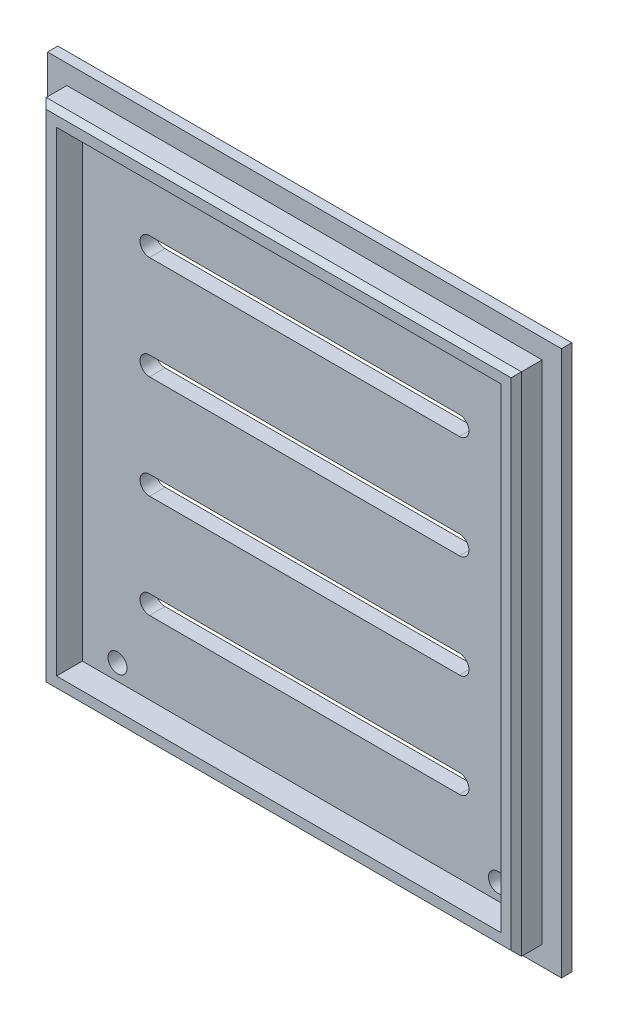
ISO-10303-21;
HEADER;
FILE_DESCRIPTION(('STEP AP214'),'2;1');
FILE_NAME('part.step','',(''),(''),'','','');
FILE_SCHEMA(('AUTOMOTIVE_DESIGN { 1 0 10303 214 1 1 1 1 }'));
ENDSEC;
DATA;
#1=APPLICATION_CONTEXT('core data for automotive mechanical design processes');
#2=APPLICATION_PROTOCOL_DEFINITION('international standard','automotive_design',2000,#1);
#3=PRODUCT_CONTEXT('',#1,'mechanical');
#4=PRODUCT('Part','Part','',(#3));
#5=PRODUCT_RELATED_PRODUCT_CATEGORY('part','',(#4));
#6=PRODUCT_DEFINITION_FORMATION('','',#4);
#7=PRODUCT_DEFINITION_CONTEXT('part definition',#1,'design');
#8=PRODUCT_DEFINITION('design','',#6,#7);
#9=PRODUCT_DEFINITION_SHAPE('','',#8);
#10=(LENGTH_UNIT() NAMED_UNIT(*) SI_UNIT(.MILLI.,.METRE.));
#11=(NAMED_UNIT(*) PLANE_ANGLE_UNIT() SI_UNIT($,.RADIAN.));
#12=(NAMED_UNIT(*) SI_UNIT($,.STERADIAN.) SOLID_ANGLE_UNIT());
#13=UNCERTAINTY_MEASURE_WITH_UNIT(LENGTH_MEASURE(1.E-05),#10,'distance_accuracy_value','');
#14=(GEOMETRIC_REPRESENTATION_CONTEXT(3) GLOBAL_UNCERTAINTY_ASSIGNED_CONTEXT((#13)) GLOBAL_UNIT_ASSIGNED_CONTEXT((#10,
#11,#12)) REPRESENTATION_CONTEXT('',''));
#15=CARTESIAN_POINT('',(0.,0.,0.));
#16=DIRECTION('',(0.,0.,1.));
#17=DIRECTION('',(1.,0.,0.));
#18=AXIS2_PLACEMENT_3D('',#15,#16,#17);
#19=CARTESIAN_POINT('',(0.,-132.75,-3475.09274967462));
#20=DIRECTION('',(0.,1.,0.));
#21=DIRECTION('',(0.,0.,1.));
#22=AXIS2_PLACEMENT_3D('',#19,#20,#21);
#23=PLANE('',#22);
#24=DIRECTION('',(1.,0.,0.));
#25=VECTOR('',#24,1.);
#26=CARTESIAN_POINT('',(0.,-132.75,-3480.09274967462));
#27=LINE('',#26,#25);
#28=CARTESIAN_POINT('',(-40.7499999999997,-132.75,-3480.09274967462));
#29=VERTEX_POINT('',#28);
#30=CARTESIAN_POINT('',(45.2500000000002,-132.75,-3480.09274967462));
#31=VERTEX_POINT('',#30);
#32=EDGE_CURVE('E448',#29,#31,#27,.T.);
#33=ORIENTED_EDGE('',*,*,#32,.F.);
#34=DIRECTION('',(0.,0.,-1.));
#35=VECTOR('',#34,1.);
#36=CARTESIAN_POINT('',(-40.7499999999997,-132.75,-3475.09274967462));
#37=LINE('',#36,#35);
#38=CARTESIAN_POINT('',(-40.7499999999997,-132.75,-3475.09274967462));
#39=VERTEX_POINT('',#38);
#40=EDGE_CURVE('E458',#39,#29,#37,.T.);
#41=ORIENTED_EDGE('',*,*,#40,.F.);
#42=DIRECTION('',(1.,0.,0.));
#43=VECTOR('',#42,1.);
#44=CARTESIAN_POINT('',(0.,-132.75,-3475.09274967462));
#45=LINE('',#44,#43);
#46=CARTESIAN_POINT('',(45.2500000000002,-132.75,-3475.09274967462));
#47=VERTEX_POINT('',#46);
#48=EDGE_CURVE('E424',#39,#47,#45,.T.);
#49=ORIENTED_EDGE('',*,*,#48,.T.);
#50=DIRECTION('',(0.,0.,-1.));
#51=VECTOR('',#50,1.);
#52=CARTESIAN_POINT('',(45.2500000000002,-132.75,-3475.09274967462));
#53=LINE('',#52,#51);
#54=EDGE_CURVE('E466',#47,#31,#53,.T.);
#55=ORIENTED_EDGE('',*,*,#54,.T.);
#56=EDGE_LOOP('',(#33,#41,#49,#55));
#57=FACE_BOUND('',#56,.T.);
#58=ADVANCED_FACE('F37',(#57),#23,.T.);
#59=CARTESIAN_POINT('',(-40.7499999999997,0.,-3475.09274967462));
#60=DIRECTION('',(-1.,0.,0.));
#61=DIRECTION('',(0.,0.,1.));
#62=AXIS2_PLACEMENT_3D('',#59,#60,#61);
#63=PLANE('',#62);
#64=DIRECTION('',(0.,1.,0.));
#65=VECTOR('',#64,1.);
#66=CARTESIAN_POINT('',(-40.7499999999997,0.,-3480.09274967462));
#67=LINE('',#66,#65);
#68=CARTESIAN_POINT('',(-40.7499999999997,-40.7499999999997,-3480.09274967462));
#69=VERTEX_POINT('',#68);
#70=EDGE_CURVE('E428',#29,#69,#67,.T.);
#71=ORIENTED_EDGE('',*,*,#70,.T.);
#72=DIRECTION('',(0.,0.,-1.));
#73=VECTOR('',#72,1.);
#74=CARTESIAN_POINT('',(-40.7499999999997,-40.7499999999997,-3475.09274967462));
#75=LINE('',#74,#73);
#76=CARTESIAN_POINT('',(-40.7499999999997,-40.7499999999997,-3475.09274967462));
#77=VERTEX_POINT('',#76);
#78=EDGE_CURVE('E461',#77,#69,#75,.T.);
#79=ORIENTED_EDGE('',*,*,#78,.F.);
#80=DIRECTION('',(0.,1.,0.));
#81=VECTOR('',#80,1.);
#82=CARTESIAN_POINT('',(-40.7499999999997,0.,-3475.09274967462));
#83=LINE('',#82,#81);
#84=EDGE_CURVE('E433',#39,#77,#83,.T.);
#85=ORIENTED_EDGE('',*,*,#84,.F.);
#86=ORIENTED_EDGE('',*,*,#40,.T.);
#87=EDGE_LOOP('',(#71,#79,#85,#86));
#88=FACE_BOUND('',#87,.T.);
#89=ADVANCED_FACE('F598',(#88),#63,.F.);
#90=CARTESIAN_POINT('',(0.,-40.7499999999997,-3475.09274967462));
#91=DIRECTION('',(0.,1.,0.));
#92=DIRECTION('',(0.,0.,1.));
#93=AXIS2_PLACEMENT_3D('',#90,#91,#92);
#94=PLANE('',#93);
#95=DIRECTION('',(1.,0.,0.));
#96=VECTOR('',#95,1.);
#97=CARTESIAN_POINT('',(0.,-40.7499999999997,-3480.09274967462));
#98=LINE('',#97,#96);
#99=CARTESIAN_POINT('',(45.2500000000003,-40.7499999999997,-3480.09274967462));
#100=VERTEX_POINT('',#99);
#101=EDGE_CURVE('E454',#69,#100,#98,.T.);
#102=ORIENTED_EDGE('',*,*,#101,.T.);
#103=DIRECTION('',(0.,0.,-1.));
#104=VECTOR('',#103,1.);
#105=CARTESIAN_POINT('',(45.2500000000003,-40.7499999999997,-3475.09274967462));
#106=LINE('',#105,#104);
#107=CARTESIAN_POINT('',(45.2500000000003,-40.7499999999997,-3475.09274967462));
#108=VERTEX_POINT('',#107);
#109=EDGE_CURVE('E463',#108,#100,#106,.T.);
#110=ORIENTED_EDGE('',*,*,#109,.F.);
#111=DIRECTION('',(1.,0.,0.));
#112=VECTOR('',#111,1.);
#113=CARTESIAN_POINT('',(0.,-40.7499999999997,-3475.09274967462));
#114=LINE('',#113,#112);
#115=EDGE_CURVE('E431',#77,#108,#114,.T.);
#116=ORIENTED_EDGE('',*,*,#115,.F.);
#117=ORIENTED_EDGE('',*,*,#78,.T.);
#118=EDGE_LOOP('',(#102,#110,#116,#117));
#119=FACE_BOUND('',#118,.T.);
#120=ADVANCED_FACE('F595',(#119),#94,.F.);
#121=CARTESIAN_POINT('',(0.,-37.7499999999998,-3475.09274967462));
#122=DIRECTION('',(0.,1.,0.));
#123=DIRECTION('',(0.,0.,1.));
#124=AXIS2_PLACEMENT_3D('',#121,#122,#123);
#125=PLANE('',#124);
#126=DIRECTION('',(0.,0.,-1.));
#127=VECTOR('',#126,1.);
#128=CARTESIAN_POINT('',(-43.7499999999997,-37.7499999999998,-3475.09274967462));
#129=LINE('',#128,#127);
#130=CARTESIAN_POINT('',(-43.7499999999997,-37.7499999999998,-3476.09274967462));
#131=VERTEX_POINT('',#130);
#132=CARTESIAN_POINT('',(-43.7499999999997,-37.7499999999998,-3480.09274967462));
#133=VERTEX_POINT('',#132);
#134=EDGE_CURVE('E468',#131,#133,#129,.T.);
#135=ORIENTED_EDGE('',*,*,#134,.F.);
#136=DIRECTION('',(1.,0.,0.));
#137=VECTOR('',#136,1.);
#138=CARTESIAN_POINT('',(48.2500000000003,-37.7499999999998,-3476.09274967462));
#139=LINE('',#138,#137);
#140=CARTESIAN_POINT('',(48.2500000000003,-37.7499999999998,-3476.09274967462));
#141=VERTEX_POINT('',#140);
#142=EDGE_CURVE('E460',#131,#141,#139,.T.);
#143=ORIENTED_EDGE('',*,*,#142,.T.);
#144=DIRECTION('',(0.,0.,-1.));
#145=VECTOR('',#144,1.);
#146=CARTESIAN_POINT('',(48.2500000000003,-37.7499999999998,-3475.09274967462));
#147=LINE('',#146,#145);
#148=CARTESIAN_POINT('',(48.2500000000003,-37.7499999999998,-3480.09274967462));
#149=VERTEX_POINT('',#148);
#150=EDGE_CURVE('E436',#141,#149,#147,.T.);
#151=ORIENTED_EDGE('',*,*,#150,.T.);
#152=DIRECTION('',(1.,0.,0.));
#153=VECTOR('',#152,1.);
#154=CARTESIAN_POINT('',(0.,-37.7499999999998,-3480.09274967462));
#155=LINE('',#154,#153);
#156=EDGE_CURVE('E423',#133,#149,#155,.T.);
#157=ORIENTED_EDGE('',*,*,#156,.F.);
#158=EDGE_LOOP('',(#135,#143,#151,#157));
#159=FACE_BOUND('',#158,.T.);
#160=ADVANCED_FACE('F621',(#159),#125,.T.);
#161=CARTESIAN_POINT('',(-43.7499999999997,0.,-3475.09274967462));
#162=DIRECTION('',(1.,0.,0.));
#163=DIRECTION('',(0.,1.,0.));
#164=AXIS2_PLACEMENT_3D('',#161,#162,#163);
#165=PLANE('',#164);
#166=DIRECTION('',(0.,0.,-1.));
#167=VECTOR('',#166,1.);
#168=CARTESIAN_POINT('',(-43.7499999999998,-135.75,-3475.09274967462));
#169=LINE('',#168,#167);
#170=CARTESIAN_POINT('',(-43.7499999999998,-135.75,-3476.09274967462));
#171=VERTEX_POINT('',#170);
#172=CARTESIAN_POINT('',(-43.7499999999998,-135.75,-3480.09274967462));
#173=VERTEX_POINT('',#172);
#174=EDGE_CURVE('E470',#171,#173,#169,.T.);
#175=ORIENTED_EDGE('',*,*,#174,.F.);
#176=DIRECTION('',(0.,1.,0.));
#177=VECTOR('',#176,1.);
#178=CARTESIAN_POINT('',(-43.7499999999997,0.,-3476.09274967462));
#179=LINE('',#178,#177);
#180=EDGE_CURVE('E486',#171,#131,#179,.T.);
#181=ORIENTED_EDGE('',*,*,#180,.T.);
#182=ORIENTED_EDGE('',*,*,#134,.T.);
#183=DIRECTION('',(0.,-1.,0.));
#184=VECTOR('',#183,1.);
#185=CARTESIAN_POINT('',(-43.7499999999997,0.,-3480.09274967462));
#186=LINE('',#185,#184);
#187=EDGE_CURVE('E445',#133,#173,#186,.T.);
#188=ORIENTED_EDGE('',*,*,#187,.T.);
#189=EDGE_LOOP('',(#175,#181,#182,#188));
#190=FACE_BOUND('',#189,.T.);
#191=ADVANCED_FACE('F617',(#190),#165,.F.);
#192=CARTESIAN_POINT('',(0.,-135.75,-3475.09274967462));
#193=DIRECTION('',(0.,1.,0.));
#194=DIRECTION('',(0.,0.,1.));
#195=AXIS2_PLACEMENT_3D('',#192,#193,#194);
#196=PLANE('',#195);
#197=DIRECTION('',(0.,0.,-1.));
#198=VECTOR('',#197,1.);
#199=CARTESIAN_POINT('',(48.2500000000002,-135.75,-3475.09274967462));
#200=LINE('',#199,#198);
#201=CARTESIAN_POINT('',(48.2500000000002,-135.75,-3476.09274967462));
#202=VERTEX_POINT('',#201);
#203=CARTESIAN_POINT('',(48.2500000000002,-135.75,-3480.09274967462));
#204=VERTEX_POINT('',#203);
#205=EDGE_CURVE('E472',#202,#204,#200,.T.);
#206=ORIENTED_EDGE('',*,*,#205,.F.);
#207=DIRECTION('',(-1.,0.,0.));
#208=VECTOR('',#207,1.);
#209=CARTESIAN_POINT('',(0.,-135.75,-3476.09274967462));
#210=LINE('',#209,#208);
#211=EDGE_CURVE('E488',#202,#171,#210,.T.);
#212=ORIENTED_EDGE('',*,*,#211,.T.);
#213=ORIENTED_EDGE('',*,*,#174,.T.);
#214=DIRECTION('',(1.,0.,0.));
#215=VECTOR('',#214,1.);
#216=CARTESIAN_POINT('',(0.,-135.75,-3480.09274967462));
#217=LINE('',#216,#215);
#218=EDGE_CURVE('E442',#173,#204,#217,.T.);
#219=ORIENTED_EDGE('',*,*,#218,.T.);
#220=EDGE_LOOP('',(#206,#212,#213,#219));
#221=FACE_BOUND('',#220,.T.);
#222=ADVANCED_FACE('F620',(#221),#196,.F.);
#223=CARTESIAN_POINT('',(48.2500000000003,0.,-3475.09274967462));
#224=DIRECTION('',(1.,0.,0.));
#225=DIRECTION('',(0.,1.,0.));
#226=AXIS2_PLACEMENT_3D('',#223,#224,#225);
#227=PLANE('',#226);
#228=ORIENTED_EDGE('',*,*,#150,.F.);
#229=DIRECTION('',(0.,-1.,0.));
#230=VECTOR('',#229,1.);
#231=CARTESIAN_POINT('',(48.2500000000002,-135.75,-3476.09274967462));
#232=LINE('',#231,#230);
#233=EDGE_CURVE('E490',#141,#202,#232,.T.);
#234=ORIENTED_EDGE('',*,*,#233,.T.);
#235=ORIENTED_EDGE('',*,*,#205,.T.);
#236=DIRECTION('',(0.,-1.,0.));
#237=VECTOR('',#236,1.);
#238=CARTESIAN_POINT('',(48.2500000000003,0.,-3480.09274967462));
#239=LINE('',#238,#237);
#240=EDGE_CURVE('E439',#149,#204,#239,.T.);
#241=ORIENTED_EDGE('',*,*,#240,.F.);
#242=EDGE_LOOP('',(#228,#234,#235,#241));
#243=FACE_BOUND('',#242,.T.);
#244=ADVANCED_FACE('F606',(#243),#227,.T.);
#245=CARTESIAN_POINT('',(45.2500000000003,0.,-3475.09274967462));
#246=DIRECTION('',(-1.,0.,0.));
#247=DIRECTION('',(0.,-1.,0.));
#248=AXIS2_PLACEMENT_3D('',#245,#246,#247);
#249=PLANE('',#248);
#250=DIRECTION('',(0.,1.,0.));
#251=VECTOR('',#250,1.);
#252=CARTESIAN_POINT('',(45.2500000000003,0.,-3480.09274967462));
#253=LINE('',#252,#251);
#254=EDGE_CURVE('E451',#31,#100,#253,.T.);
#255=ORIENTED_EDGE('',*,*,#254,.F.);
#256=ORIENTED_EDGE('',*,*,#54,.F.);
#257=DIRECTION('',(0.,1.,0.));
#258=VECTOR('',#257,1.);
#259=CARTESIAN_POINT('',(45.2500000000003,0.,-3475.09274967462));
#260=LINE('',#259,#258);
#261=EDGE_CURVE('E427',#47,#108,#260,.T.);
#262=ORIENTED_EDGE('',*,*,#261,.T.);
#263=ORIENTED_EDGE('',*,*,#109,.T.);
#264=EDGE_LOOP('',(#255,#256,#262,#263));
#265=FACE_BOUND('',#264,.T.);
#266=ADVANCED_FACE('F592',(#265),#249,.T.);
#267=CARTESIAN_POINT('',(0.,0.,-3475.09274967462));
#268=DIRECTION('',(0.,0.,-1.));
#269=DIRECTION('',(-1.,0.,0.));
#270=AXIS2_PLACEMENT_3D('',#267,#268,#269);
#271=PLANE('',#270);
#272=DIRECTION('',(0.,1.,0.));
#273=VECTOR('',#272,1.);
#274=CARTESIAN_POINT('',(47.2500000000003,-37.7499999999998,-3475.09274967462));
#275=LINE('',#274,#273);
#276=CARTESIAN_POINT('',(47.2500000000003,-134.75,-3475.09274967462));
#277=VERTEX_POINT('',#276);
#278=CARTESIAN_POINT('',(47.2500000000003,-38.7499999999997,-3475.09274967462));
#279=VERTEX_POINT('',#278);
#280=EDGE_CURVE('E477',#277,#279,#275,.T.);
#281=ORIENTED_EDGE('',*,*,#280,.T.);
#282=DIRECTION('',(-1.,0.,0.));
#283=VECTOR('',#282,1.);
#284=CARTESIAN_POINT('',(-43.7499999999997,-38.7499999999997,-3475.09274967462));
#285=LINE('',#284,#283);
#286=CARTESIAN_POINT('',(-42.7499999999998,-38.7499999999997,-3475.09274967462));
#287=VERTEX_POINT('',#286);
#288=EDGE_CURVE('E483',#279,#287,#285,.T.);
#289=ORIENTED_EDGE('',*,*,#288,.T.);
#290=DIRECTION('',(0.,-1.,0.));
#291=VECTOR('',#290,1.);
#292=CARTESIAN_POINT('',(-42.7499999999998,0.,-3475.09274967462));
#293=LINE('',#292,#291);
#294=CARTESIAN_POINT('',(-42.7499999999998,-134.75,-3475.09274967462));
#295=VERTEX_POINT('',#294);
#296=EDGE_CURVE('E481',#287,#295,#293,.T.);
#297=ORIENTED_EDGE('',*,*,#296,.T.);
#298=DIRECTION('',(1.,0.,0.));
#299=VECTOR('',#298,1.);
#300=CARTESIAN_POINT('',(0.,-134.75,-3475.09274967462));
#301=LINE('',#300,#299);
#302=EDGE_CURVE('E479',#295,#277,#301,.T.);
#303=ORIENTED_EDGE('',*,*,#302,.T.);
#304=EDGE_LOOP('',(#281,#289,#297,#303));
#305=FACE_BOUND('',#304,.T.);
#306=ORIENTED_EDGE('',*,*,#48,.F.);
#307=ORIENTED_EDGE('',*,*,#84,.T.);
#308=ORIENTED_EDGE('',*,*,#115,.T.);
#309=ORIENTED_EDGE('',*,*,#261,.F.);
#310=EDGE_LOOP('',(#306,#307,#308,#309));
#311=FACE_BOUND('',#310,.T.);
#312=ADVANCED_FACE('F580',(#305,#311),#271,.F.);
#313=CARTESIAN_POINT('',(0.,0.,-3480.09274967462));
#314=DIRECTION('',(0.,0.,-1.));
#315=DIRECTION('',(-1.,0.,0.));
#316=AXIS2_PLACEMENT_3D('',#313,#314,#315);
#317=PLANE('',#316);
#318=DIRECTION('',(1.,0.,0.));
#319=VECTOR('',#318,1.);
#320=CARTESIAN_POINT('',(32.2500000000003,-118.59,-3480.09274967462));
#321=LINE('',#320,#319);
#322=CARTESIAN_POINT('',(-27.7499999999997,-118.59,-3480.09274967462));
#323=VERTEX_POINT('',#322);
#324=CARTESIAN_POINT('',(32.2500000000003,-118.59,-3480.09274967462));
#325=VERTEX_POINT('',#324);
#326=EDGE_CURVE('E266',#323,#325,#321,.T.);
#327=ORIENTED_EDGE('',*,*,#326,.F.);
#328=CARTESIAN_POINT('',(-27.7499999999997,-116.75,-3480.09274967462));
#329=DIRECTION('',(0.,0.,1.));
#330=DIRECTION('',(-1.,0.,0.));
#331=AXIS2_PLACEMENT_3D('',#328,#329,#330);
#332=CIRCLE('',#331,1.84000000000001);
#333=CARTESIAN_POINT('',(-27.7499999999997,-114.91,-3480.09274967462));
#334=VERTEX_POINT('',#333);
#335=EDGE_CURVE('E54',#334,#323,#332,.T.);
#336=ORIENTED_EDGE('',*,*,#335,.F.);
#337=DIRECTION('',(-1.,0.,0.));
#338=VECTOR('',#337,1.);
#339=CARTESIAN_POINT('',(-27.7499999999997,-114.91,-3480.09274967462));
#340=LINE('',#339,#338);
#341=CARTESIAN_POINT('',(32.2500000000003,-114.91,-3480.09274967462));
#342=VERTEX_POINT('',#341);
#343=EDGE_CURVE('E259',#342,#334,#340,.T.);
#344=ORIENTED_EDGE('',*,*,#343,.F.);
#345=CARTESIAN_POINT('',(32.2500000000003,-116.75,-3480.09274967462));
#346=DIRECTION('',(0.,0.,1.));
#347=DIRECTION('',(-1.,0.,0.));
#348=AXIS2_PLACEMENT_3D('',#345,#346,#347);
#349=CIRCLE('',#348,1.84000000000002);
#350=EDGE_CURVE('E273',#325,#342,#349,.T.);
#351=ORIENTED_EDGE('',*,*,#350,.F.);
#352=EDGE_LOOP('',(#327,#336,#344,#351));
#353=FACE_BOUND('',#352,.T.);
#354=DIRECTION('',(-1.,0.,0.));
#355=VECTOR('',#354,1.);
#356=CARTESIAN_POINT('',(32.2500000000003,-94.9099999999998,-3480.09274967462));
#357=LINE('',#356,#355);
#358=CARTESIAN_POINT('',(32.2500000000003,-94.9099999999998,-3480.09274967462));
#359=VERTEX_POINT('',#358);
#360=CARTESIAN_POINT('',(-27.7499999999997,-94.9099999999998,-3480.09274967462));
#361=VERTEX_POINT('',#360);
#362=EDGE_CURVE('E292',#359,#361,#357,.T.);
#363=ORIENTED_EDGE('',*,*,#362,.F.);
#364=CARTESIAN_POINT('',(32.2500000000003,-96.7499999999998,-3480.09274967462));
#365=DIRECTION('',(0.,0.,1.));
#366=DIRECTION('',(1.,0.,0.));
#367=AXIS2_PLACEMENT_3D('',#364,#365,#366);
#368=CIRCLE('',#367,1.83999999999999);
#369=CARTESIAN_POINT('',(32.2500000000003,-98.5899999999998,-3480.09274967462));
#370=VERTEX_POINT('',#369);
#371=EDGE_CURVE('E290',#370,#359,#368,.T.);
#372=ORIENTED_EDGE('',*,*,#371,.F.);
#373=DIRECTION('',(1.,0.,0.));
#374=VECTOR('',#373,1.);
#375=CARTESIAN_POINT('',(-27.7499999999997,-98.5899999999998,-3480.09274967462));
#376=LINE('',#375,#374);
#377=CARTESIAN_POINT('',(-27.7499999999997,-98.5899999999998,-3480.09274967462));
#378=VERTEX_POINT('',#377);
#379=EDGE_CURVE('E298',#378,#370,#376,.T.);
#380=ORIENTED_EDGE('',*,*,#379,.F.);
#381=CARTESIAN_POINT('',(-27.7499999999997,-96.7499999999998,-3480.09274967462));
#382=DIRECTION('',(0.,0.,1.));
#383=DIRECTION('',(1.,0.,0.));
#384=AXIS2_PLACEMENT_3D('',#381,#382,#383);
#385=CIRCLE('',#384,1.83999999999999);
#386=EDGE_CURVE('E295',#361,#378,#385,.T.);
#387=ORIENTED_EDGE('',*,*,#386,.F.);
#388=EDGE_LOOP('',(#363,#372,#380,#387));
#389=FACE_BOUND('',#388,.T.);
#390=DIRECTION('',(-1.,0.,0.));
#391=VECTOR('',#390,1.);
#392=CARTESIAN_POINT('',(32.2500000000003,-74.9099999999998,-3480.09274967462));
#393=LINE('',#392,#391);
#394=CARTESIAN_POINT('',(32.2500000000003,-74.9099999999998,-3480.09274967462));
#395=VERTEX_POINT('',#394);
#396=CARTESIAN_POINT('',(-27.7499999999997,-74.9099999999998,-3480.09274967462));
#397=VERTEX_POINT('',#396);
#398=EDGE_CURVE('E324',#395,#397,#393,.T.);
#399=ORIENTED_EDGE('',*,*,#398,.F.);
#400=CARTESIAN_POINT('',(32.2500000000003,-76.7499999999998,-3480.09274967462));
#401=DIRECTION('',(0.,0.,1.));
#402=DIRECTION('',(1.,0.,0.));
#403=AXIS2_PLACEMENT_3D('',#400,#401,#402);
#404=CIRCLE('',#403,1.84000000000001);
#405=CARTESIAN_POINT('',(32.2500000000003,-78.5899999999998,-3480.09274967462));
#406=VERTEX_POINT('',#405);
#407=EDGE_CURVE('E322',#406,#395,#404,.T.);
#408=ORIENTED_EDGE('',*,*,#407,.F.);
#409=DIRECTION('',(1.,0.,0.));
#410=VECTOR('',#409,1.);
#411=CARTESIAN_POINT('',(-27.7499999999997,-78.5899999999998,-3480.09274967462));
#412=LINE('',#411,#410);
#413=CARTESIAN_POINT('',(-27.7499999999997,-78.5899999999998,-3480.09274967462));
#414=VERTEX_POINT('',#413);
#415=EDGE_CURVE('E330',#414,#406,#412,.T.);
#416=ORIENTED_EDGE('',*,*,#415,.F.);
#417=CARTESIAN_POINT('',(-27.7499999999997,-76.7499999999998,-3480.09274967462));
#418=DIRECTION('',(0.,0.,1.));
#419=DIRECTION('',(1.,0.,0.));
#420=AXIS2_PLACEMENT_3D('',#417,#418,#419);
#421=CIRCLE('',#420,1.84000000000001);
#422=EDGE_CURVE('E327',#397,#414,#421,.T.);
#423=ORIENTED_EDGE('',*,*,#422,.F.);
#424=EDGE_LOOP('',(#399,#408,#416,#423));
#425=FACE_BOUND('',#424,.T.);
#426=DIRECTION('',(-1.,0.,0.));
#427=VECTOR('',#426,1.);
#428=CARTESIAN_POINT('',(32.2500000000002,-54.9099999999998,-3480.09274967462));
#429=LINE('',#428,#427);
#430=CARTESIAN_POINT('',(32.2500000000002,-54.9099999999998,-3480.09274967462));
#431=VERTEX_POINT('',#430);
#432=CARTESIAN_POINT('',(-27.7499999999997,-54.9099999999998,-3480.09274967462));
#433=VERTEX_POINT('',#432);
#434=EDGE_CURVE('E356',#431,#433,#429,.T.);
#435=ORIENTED_EDGE('',*,*,#434,.F.);
#436=CARTESIAN_POINT('',(32.2500000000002,-56.7499999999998,-3480.09274967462));
#437=DIRECTION('',(0.,0.,1.));
#438=DIRECTION('',(1.,0.,0.));
#439=AXIS2_PLACEMENT_3D('',#436,#437,#438);
#440=CIRCLE('',#439,1.84);
#441=CARTESIAN_POINT('',(32.2500000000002,-58.5899999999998,-3480.09274967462));
#442=VERTEX_POINT('',#441);
#443=EDGE_CURVE('E354',#442,#431,#440,.T.);
#444=ORIENTED_EDGE('',*,*,#443,.F.);
#445=DIRECTION('',(1.,0.,0.));
#446=VECTOR('',#445,1.);
#447=CARTESIAN_POINT('',(-27.7499999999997,-58.5899999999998,-3480.09274967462));
#448=LINE('',#447,#446);
#449=CARTESIAN_POINT('',(-27.7499999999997,-58.5899999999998,-3480.09274967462));
#450=VERTEX_POINT('',#449);
#451=EDGE_CURVE('E362',#450,#442,#448,.T.);
#452=ORIENTED_EDGE('',*,*,#451,.F.);
#453=CARTESIAN_POINT('',(-27.7499999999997,-56.7499999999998,-3480.09274967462));
#454=DIRECTION('',(0.,0.,1.));
#455=DIRECTION('',(1.,0.,0.));
#456=AXIS2_PLACEMENT_3D('',#453,#454,#455);
#457=CIRCLE('',#456,1.84);
#458=EDGE_CURVE('E359',#433,#450,#457,.T.);
#459=ORIENTED_EDGE('',*,*,#458,.F.);
#460=EDGE_LOOP('',(#435,#444,#452,#459));
#461=FACE_BOUND('',#460,.T.);
#462=CARTESIAN_POINT('',(-37.7549999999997,-43.8849999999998,-3480.09274967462));
#463=DIRECTION('',(0.,0.,-1.));
#464=DIRECTION('',(-1.,0.,0.));
#465=AXIS2_PLACEMENT_3D('',#462,#463,#464);
#466=CIRCLE('',#465,1.84);
#467=CARTESIAN_POINT('',(-39.5949999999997,-43.8849999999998,-3480.09274967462));
#468=VERTEX_POINT('',#467);
#469=EDGE_CURVE('E381',#468,#468,#466,.F.);
#470=ORIENTED_EDGE('',*,*,#469,.F.);
#471=EDGE_LOOP('',(#470));
#472=FACE_BOUND('',#471,.T.);
#473=CARTESIAN_POINT('',(42.2550000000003,-43.8849999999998,-3480.09274967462));
#474=DIRECTION('',(0.,0.,-1.));
#475=DIRECTION('',(-1.,0.,0.));
#476=AXIS2_PLACEMENT_3D('',#473,#474,#475);
#477=CIRCLE('',#476,1.84);
#478=CARTESIAN_POINT('',(40.4150000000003,-43.8849999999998,-3480.09274967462));
#479=VERTEX_POINT('',#478);
#480=EDGE_CURVE('E388',#479,#479,#477,.F.);
#481=ORIENTED_EDGE('',*,*,#480,.F.);
#482=EDGE_LOOP('',(#481));
#483=FACE_BOUND('',#482,.T.);
#484=CARTESIAN_POINT('',(39.7150000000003,-129.615,-3480.09274967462));
#485=DIRECTION('',(0.,0.,-1.));
#486=DIRECTION('',(-1.,0.,0.));
#487=AXIS2_PLACEMENT_3D('',#484,#485,#486);
#488=CIRCLE('',#487,1.84);
#489=CARTESIAN_POINT('',(37.8750000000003,-129.615,-3480.09274967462));
#490=VERTEX_POINT('',#489);
#491=EDGE_CURVE('E394',#490,#490,#488,.F.);
#492=ORIENTED_EDGE('',*,*,#491,.F.);
#493=EDGE_LOOP('',(#492));
#494=FACE_BOUND('',#493,.T.);
#495=CARTESIAN_POINT('',(-33.9449999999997,-129.615,-3480.09274967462));
#496=DIRECTION('',(0.,0.,-1.));
#497=DIRECTION('',(-1.,0.,0.));
#498=AXIS2_PLACEMENT_3D('',#495,#496,#497);
#499=CIRCLE('',#498,1.84);
#500=CARTESIAN_POINT('',(-35.7849999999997,-129.615,-3480.09274967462));
#501=VERTEX_POINT('',#500);
#502=EDGE_CURVE('E400',#501,#501,#499,.F.);
#503=ORIENTED_EDGE('',*,*,#502,.F.);
#504=EDGE_LOOP('',(#503));
#505=FACE_BOUND('',#504,.T.);
#506=ORIENTED_EDGE('',*,*,#32,.T.);
#507=ORIENTED_EDGE('',*,*,#254,.T.);
#508=ORIENTED_EDGE('',*,*,#101,.F.);
#509=ORIENTED_EDGE('',*,*,#70,.F.);
#510=EDGE_LOOP('',(#506,#507,#508,#509));
#511=FACE_BOUND('',#510,.T.);
#512=ADVANCED_FACE('F577',(#353,#389,#425,#461,#472,#483,#494,#505,#511),#317,.F.);
#513=ORIENTED_EDGE('',*,*,#156,.T.);
#514=ORIENTED_EDGE('',*,*,#240,.T.);
#515=ORIENTED_EDGE('',*,*,#218,.F.);
#516=ORIENTED_EDGE('',*,*,#187,.F.);
#517=EDGE_LOOP('',(#513,#514,#515,#516));
#518=FACE_BOUND('',#517,.T.);
#519=DIRECTION('',(-1.,0.,0.));
#520=VECTOR('',#519,1.);
#521=CARTESIAN_POINT('',(0.,-139.5,-3480.09274967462));
#522=LINE('',#521,#520);
#523=CARTESIAN_POINT('',(52.0000000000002,-139.5,-3480.09274967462));
#524=VERTEX_POINT('',#523);
#525=CARTESIAN_POINT('',(-47.4999999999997,-139.5,-3480.09274967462));
#526=VERTEX_POINT('',#525);
#527=EDGE_CURVE('E403',#524,#526,#522,.T.);
#528=ORIENTED_EDGE('',*,*,#527,.F.);
#529=DIRECTION('',(0.,-1.,0.));
#530=VECTOR('',#529,1.);
#531=CARTESIAN_POINT('',(52.0000000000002,0.,-3480.09274967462));
#532=LINE('',#531,#530);
#533=CARTESIAN_POINT('',(52.0000000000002,-33.9999999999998,-3480.09274967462));
#534=VERTEX_POINT('',#533);
#535=EDGE_CURVE('E412',#534,#524,#532,.T.);
#536=ORIENTED_EDGE('',*,*,#535,.F.);
#537=DIRECTION('',(1.,0.,0.));
#538=VECTOR('',#537,1.);
#539=CARTESIAN_POINT('',(0.,-33.9999999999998,-3480.09274967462));
#540=LINE('',#539,#538);
#541=CARTESIAN_POINT('',(-47.4999999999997,-33.9999999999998,-3480.09274967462));
#542=VERTEX_POINT('',#541);
#543=EDGE_CURVE('E409',#542,#534,#540,.T.);
#544=ORIENTED_EDGE('',*,*,#543,.F.);
#545=DIRECTION('',(0.,1.,0.));
#546=VECTOR('',#545,1.);
#547=CARTESIAN_POINT('',(-47.4999999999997,0.,-3480.09274967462));
#548=LINE('',#547,#546);
#549=EDGE_CURVE('E406',#526,#542,#548,.T.);
#550=ORIENTED_EDGE('',*,*,#549,.F.);
#551=EDGE_LOOP('',(#528,#536,#544,#550));
#552=FACE_BOUND('',#551,.T.);
#553=ADVANCED_FACE('F546',(#518,#552),#317,.F.);
#554=CARTESIAN_POINT('',(0.,-139.5,-3483.09274967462));
#555=DIRECTION('',(0.,1.,0.));
#556=DIRECTION('',(0.,0.,1.));
#557=AXIS2_PLACEMENT_3D('',#554,#555,#556);
#558=PLANE('',#557);
#559=DIRECTION('',(0.,0.,1.));
#560=VECTOR('',#559,1.);
#561=CARTESIAN_POINT('',(-47.4999999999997,-139.5,-3483.09274967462));
#562=LINE('',#561,#560);
#563=CARTESIAN_POINT('',(-47.4999999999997,-139.5,-3482.09274967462));
#564=VERTEX_POINT('',#563);
#565=EDGE_CURVE('E421',#564,#526,#562,.T.);
#566=ORIENTED_EDGE('',*,*,#565,.F.);
#567=DIRECTION('',(1.,0.,0.));
#568=VECTOR('',#567,1.);
#569=CARTESIAN_POINT('',(52.0000000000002,-139.5,-3482.09274967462));
#570=LINE('',#569,#568);
#571=CARTESIAN_POINT('',(52.0000000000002,-139.5,-3482.09274967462));
#572=VERTEX_POINT('',#571);
#573=EDGE_CURVE('E11',#564,#572,#570,.T.);
#574=ORIENTED_EDGE('',*,*,#573,.T.);
#575=DIRECTION('',(0.,0.,1.));
#576=VECTOR('',#575,1.);
#577=CARTESIAN_POINT('',(52.0000000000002,-139.5,-3483.09274967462));
#578=LINE('',#577,#576);
#579=EDGE_CURVE('E415',#572,#524,#578,.T.);
#580=ORIENTED_EDGE('',*,*,#579,.T.);
#581=ORIENTED_EDGE('',*,*,#527,.T.);
#582=EDGE_LOOP('',(#566,#574,#580,#581));
#583=FACE_BOUND('',#582,.T.);
#584=ADVANCED_FACE('F549',(#583),#558,.F.);
#585=CARTESIAN_POINT('',(-47.4999999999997,0.,-3483.09274967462));
#586=DIRECTION('',(1.,0.,0.));
#587=DIRECTION('',(0.,0.,-1.));
#588=AXIS2_PLACEMENT_3D('',#585,#586,#587);
#589=PLANE('',#588);
#590=DIRECTION('',(0.,0.,1.));
#591=VECTOR('',#590,1.);
#592=CARTESIAN_POINT('',(-47.4999999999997,-33.9999999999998,-3483.09274967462));
#593=LINE('',#592,#591);
#594=CARTESIAN_POINT('',(-47.4999999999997,-33.9999999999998,-3482.09274967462));
#595=VERTEX_POINT('',#594);
#596=EDGE_CURVE('E419',#595,#542,#593,.T.);
#597=ORIENTED_EDGE('',*,*,#596,.F.);
#598=DIRECTION('',(0.,-1.,0.));
#599=VECTOR('',#598,1.);
#600=CARTESIAN_POINT('',(-47.4999999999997,-139.5,-3482.09274967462));
#601=LINE('',#600,#599);
#602=EDGE_CURVE('E501',#595,#564,#601,.T.);
#603=ORIENTED_EDGE('',*,*,#602,.T.);
#604=ORIENTED_EDGE('',*,*,#565,.T.);
#605=ORIENTED_EDGE('',*,*,#549,.T.);
#606=EDGE_LOOP('',(#597,#603,#604,#605));
#607=FACE_BOUND('',#606,.T.);
#608=ADVANCED_FACE('F551',(#607),#589,.F.);
#609=CARTESIAN_POINT('',(0.,-33.9999999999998,-3483.09274967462));
#610=DIRECTION('',(0.,-1.,0.));
#611=DIRECTION('',(0.,0.,-1.));
#612=AXIS2_PLACEMENT_3D('',#609,#610,#611);
#613=PLANE('',#612);
#614=DIRECTION('',(0.,0.,1.));
#615=VECTOR('',#614,1.);
#616=CARTESIAN_POINT('',(52.0000000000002,-33.9999999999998,-3483.09274967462));
#617=LINE('',#616,#615);
#618=CARTESIAN_POINT('',(52.0000000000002,-33.9999999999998,-3482.09274967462));
#619=VERTEX_POINT('',#618);
#620=EDGE_CURVE('E417',#619,#534,#617,.T.);
#621=ORIENTED_EDGE('',*,*,#620,.F.);
#622=DIRECTION('',(-1.,0.,0.));
#623=VECTOR('',#622,1.);
#624=CARTESIAN_POINT('',(-47.4999999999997,-33.9999999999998,-3482.09274967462));
#625=LINE('',#624,#623);
#626=EDGE_CURVE('E504',#619,#595,#625,.T.);
#627=ORIENTED_EDGE('',*,*,#626,.T.);
#628=ORIENTED_EDGE('',*,*,#596,.T.);
#629=ORIENTED_EDGE('',*,*,#543,.T.);
#630=EDGE_LOOP('',(#621,#627,#628,#629));
#631=FACE_BOUND('',#630,.T.);
#632=ADVANCED_FACE('F539',(#631),#613,.F.);
#633=CARTESIAN_POINT('',(52.0000000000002,0.,-3483.09274967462));
#634=DIRECTION('',(-1.,0.,0.));
#635=DIRECTION('',(0.,0.,1.));
#636=AXIS2_PLACEMENT_3D('',#633,#634,#635);
#637=PLANE('',#636);
#638=ORIENTED_EDGE('',*,*,#579,.F.);
#639=DIRECTION('',(0.,1.,0.));
#640=VECTOR('',#639,1.);
#641=CARTESIAN_POINT('',(52.0000000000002,-33.9999999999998,-3482.09274967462));
#642=LINE('',#641,#640);
#643=EDGE_CURVE('E46',#572,#619,#642,.T.);
#644=ORIENTED_EDGE('',*,*,#643,.T.);
#645=ORIENTED_EDGE('',*,*,#620,.T.);
#646=ORIENTED_EDGE('',*,*,#535,.T.);
#647=EDGE_LOOP('',(#638,#644,#645,#646));
#648=FACE_BOUND('',#647,.T.);
#649=ADVANCED_FACE('F537',(#648),#637,.F.);
#650=CARTESIAN_POINT('',(0.,0.,-3483.09274967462));
#651=DIRECTION('',(0.,0.,-1.));
#652=DIRECTION('',(-1.,0.,0.));
#653=AXIS2_PLACEMENT_3D('',#650,#651,#652);
#654=PLANE('',#653);
#655=CARTESIAN_POINT('',(-27.7499999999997,-116.75,-3483.09274967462));
#656=DIRECTION('',(0.,0.,-1.));
#657=DIRECTION('',(-1.,0.,0.));
#658=AXIS2_PLACEMENT_3D('',#655,#656,#657);
#659=CIRCLE('',#658,1.84000000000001);
#660=CARTESIAN_POINT('',(-27.7499999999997,-114.91,-3483.09274967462));
#661=VERTEX_POINT('',#660);
#662=CARTESIAN_POINT('',(-27.7499999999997,-118.59,-3483.09274967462));
#663=VERTEX_POINT('',#662);
#664=EDGE_CURVE('E257',#661,#663,#659,.F.);
#665=ORIENTED_EDGE('',*,*,#664,.T.);
#666=DIRECTION('',(1.,0.,0.));
#667=VECTOR('',#666,1.);
#668=CARTESIAN_POINT('',(32.2500000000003,-118.59,-3483.09274967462));
#669=LINE('',#668,#667);
#670=CARTESIAN_POINT('',(32.2500000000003,-118.59,-3483.09274967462));
#671=VERTEX_POINT('',#670);
#672=EDGE_CURVE('E246',#663,#671,#669,.T.);
#673=ORIENTED_EDGE('',*,*,#672,.T.);
#674=CARTESIAN_POINT('',(32.2500000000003,-116.75,-3483.09274967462));
#675=DIRECTION('',(0.,0.,-1.));
#676=DIRECTION('',(-1.,0.,0.));
#677=AXIS2_PLACEMENT_3D('',#674,#675,#676);
#678=CIRCLE('',#677,1.84000000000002);
#679=CARTESIAN_POINT('',(32.2500000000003,-114.91,-3483.09274967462));
#680=VERTEX_POINT('',#679);
#681=EDGE_CURVE('E268',#671,#680,#678,.F.);
#682=ORIENTED_EDGE('',*,*,#681,.T.);
#683=DIRECTION('',(-1.,0.,0.));
#684=VECTOR('',#683,1.);
#685=CARTESIAN_POINT('',(-27.7499999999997,-114.91,-3483.09274967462));
#686=LINE('',#685,#684);
#687=EDGE_CURVE('E264',#680,#661,#686,.T.);
#688=ORIENTED_EDGE('',*,*,#687,.T.);
#689=EDGE_LOOP('',(#665,#673,#682,#688));
#690=FACE_BOUND('',#689,.T.);
#691=CARTESIAN_POINT('',(32.2500000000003,-96.7499999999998,-3483.09274967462));
#692=DIRECTION('',(0.,0.,-1.));
#693=DIRECTION('',(-1.,0.,0.));
#694=AXIS2_PLACEMENT_3D('',#691,#692,#693);
#695=CIRCLE('',#694,1.83999999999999);
#696=CARTESIAN_POINT('',(32.2500000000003,-98.5899999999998,-3483.09274967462));
#697=VERTEX_POINT('',#696);
#698=CARTESIAN_POINT('',(32.2500000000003,-94.9099999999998,-3483.09274967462));
#699=VERTEX_POINT('',#698);
#700=EDGE_CURVE('E287',#697,#699,#695,.F.);
#701=ORIENTED_EDGE('',*,*,#700,.T.);
#702=DIRECTION('',(-1.,0.,0.));
#703=VECTOR('',#702,1.);
#704=CARTESIAN_POINT('',(32.2500000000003,-94.9099999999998,-3483.09274967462));
#705=LINE('',#704,#703);
#706=CARTESIAN_POINT('',(-27.7499999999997,-94.9099999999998,-3483.09274967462));
#707=VERTEX_POINT('',#706);
#708=EDGE_CURVE('E304',#699,#707,#705,.T.);
#709=ORIENTED_EDGE('',*,*,#708,.T.);
#710=CARTESIAN_POINT('',(-27.7499999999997,-96.7499999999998,-3483.09274967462));
#711=DIRECTION('',(0.,0.,-1.));
#712=DIRECTION('',(-1.,0.,0.));
#713=AXIS2_PLACEMENT_3D('',#710,#711,#712);
#714=CIRCLE('',#713,1.83999999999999);
#715=CARTESIAN_POINT('',(-27.7499999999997,-98.5899999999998,-3483.09274967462));
#716=VERTEX_POINT('',#715);
#717=EDGE_CURVE('E253',#707,#716,#714,.F.);
#718=ORIENTED_EDGE('',*,*,#717,.T.);
#719=DIRECTION('',(1.,0.,0.));
#720=VECTOR('',#719,1.);
#721=CARTESIAN_POINT('',(-27.7499999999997,-98.5899999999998,-3483.09274967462));
#722=LINE('',#721,#720);
#723=EDGE_CURVE('E284',#716,#697,#722,.T.);
#724=ORIENTED_EDGE('',*,*,#723,.T.);
#725=EDGE_LOOP('',(#701,#709,#718,#724));
#726=FACE_BOUND('',#725,.T.);
#727=CARTESIAN_POINT('',(32.2500000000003,-76.7499999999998,-3483.09274967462));
#728=DIRECTION('',(0.,0.,-1.));
#729=DIRECTION('',(-1.,0.,0.));
#730=AXIS2_PLACEMENT_3D('',#727,#728,#729);
#731=CIRCLE('',#730,1.84000000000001);
#732=CARTESIAN_POINT('',(32.2500000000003,-78.5899999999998,-3483.09274967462));
#733=VERTEX_POINT('',#732);
#734=CARTESIAN_POINT('',(32.2500000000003,-74.9099999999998,-3483.09274967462));
#735=VERTEX_POINT('',#734);
#736=EDGE_CURVE('E319',#733,#735,#731,.F.);
#737=ORIENTED_EDGE('',*,*,#736,.T.);
#738=DIRECTION('',(-1.,0.,0.));
#739=VECTOR('',#738,1.);
#740=CARTESIAN_POINT('',(32.2500000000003,-74.9099999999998,-3483.09274967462));
#741=LINE('',#740,#739);
#742=CARTESIAN_POINT('',(-27.7499999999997,-74.9099999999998,-3483.09274967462));
#743=VERTEX_POINT('',#742);
#744=EDGE_CURVE('E336',#735,#743,#741,.T.);
#745=ORIENTED_EDGE('',*,*,#744,.T.);
#746=CARTESIAN_POINT('',(-27.7499999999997,-76.7499999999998,-3483.09274967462));
#747=DIRECTION('',(0.,0.,-1.));
#748=DIRECTION('',(-1.,0.,0.));
#749=AXIS2_PLACEMENT_3D('',#746,#747,#748);
#750=CIRCLE('',#749,1.84000000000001);
#751=CARTESIAN_POINT('',(-27.7499999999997,-78.5899999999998,-3483.09274967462));
#752=VERTEX_POINT('',#751);
#753=EDGE_CURVE('E313',#743,#752,#750,.F.);
#754=ORIENTED_EDGE('',*,*,#753,.T.);
#755=DIRECTION('',(1.,0.,0.));
#756=VECTOR('',#755,1.);
#757=CARTESIAN_POINT('',(-27.7499999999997,-78.5899999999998,-3483.09274967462));
#758=LINE('',#757,#756);
#759=EDGE_CURVE('E316',#752,#733,#758,.T.);
#760=ORIENTED_EDGE('',*,*,#759,.T.);
#761=EDGE_LOOP('',(#737,#745,#754,#760));
#762=FACE_BOUND('',#761,.T.);
#763=CARTESIAN_POINT('',(32.2500000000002,-56.7499999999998,-3483.09274967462));
#764=DIRECTION('',(0.,0.,-1.));
#765=DIRECTION('',(-1.,0.,0.));
#766=AXIS2_PLACEMENT_3D('',#763,#764,#765);
#767=CIRCLE('',#766,1.84);
#768=CARTESIAN_POINT('',(32.2500000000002,-58.5899999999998,-3483.09274967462));
#769=VERTEX_POINT('',#768);
#770=CARTESIAN_POINT('',(32.2500000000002,-54.9099999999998,-3483.09274967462));
#771=VERTEX_POINT('',#770);
#772=EDGE_CURVE('E351',#769,#771,#767,.F.);
#773=ORIENTED_EDGE('',*,*,#772,.T.);
#774=DIRECTION('',(-1.,0.,0.));
#775=VECTOR('',#774,1.);
#776=CARTESIAN_POINT('',(32.2500000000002,-54.9099999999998,-3483.09274967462));
#777=LINE('',#776,#775);
#778=CARTESIAN_POINT('',(-27.7499999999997,-54.9099999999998,-3483.09274967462));
#779=VERTEX_POINT('',#778);
#780=EDGE_CURVE('E368',#771,#779,#777,.T.);
#781=ORIENTED_EDGE('',*,*,#780,.T.);
#782=CARTESIAN_POINT('',(-27.7499999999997,-56.7499999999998,-3483.09274967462));
#783=DIRECTION('',(0.,0.,-1.));
#784=DIRECTION('',(-1.,0.,0.));
#785=AXIS2_PLACEMENT_3D('',#782,#783,#784);
#786=CIRCLE('',#785,1.84);
#787=CARTESIAN_POINT('',(-27.7499999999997,-58.5899999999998,-3483.09274967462));
#788=VERTEX_POINT('',#787);
#789=EDGE_CURVE('E345',#779,#788,#786,.F.);
#790=ORIENTED_EDGE('',*,*,#789,.T.);
#791=DIRECTION('',(1.,0.,0.));
#792=VECTOR('',#791,1.);
#793=CARTESIAN_POINT('',(-27.7499999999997,-58.5899999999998,-3483.09274967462));
#794=LINE('',#793,#792);
#795=EDGE_CURVE('E348',#788,#769,#794,.T.);
#796=ORIENTED_EDGE('',*,*,#795,.T.);
#797=EDGE_LOOP('',(#773,#781,#790,#796));
#798=FACE_BOUND('',#797,.T.);
#799=DIRECTION('',(-1.,0.,0.));
#800=VECTOR('',#799,1.);
#801=CARTESIAN_POINT('',(-47.4999999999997,-138.5,-3483.09274967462));
#802=LINE('',#801,#800);
#803=CARTESIAN_POINT('',(51.0000000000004,-138.5,-3483.09274967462));
#804=VERTEX_POINT('',#803);
#805=CARTESIAN_POINT('',(-46.4999999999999,-138.5,-3483.09274967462));
#806=VERTEX_POINT('',#805);
#807=EDGE_CURVE('E492',#804,#806,#802,.T.);
#808=ORIENTED_EDGE('',*,*,#807,.T.);
#809=DIRECTION('',(0.,1.,0.));
#810=VECTOR('',#809,1.);
#811=CARTESIAN_POINT('',(-46.4999999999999,-33.9999999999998,-3483.09274967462));
#812=LINE('',#811,#810);
#813=CARTESIAN_POINT('',(-46.4999999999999,-34.9999999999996,-3483.09274967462));
#814=VERTEX_POINT('',#813);
#815=EDGE_CURVE('E498',#806,#814,#812,.T.);
#816=ORIENTED_EDGE('',*,*,#815,.T.);
#817=DIRECTION('',(1.,0.,0.));
#818=VECTOR('',#817,1.);
#819=CARTESIAN_POINT('',(52.0000000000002,-34.9999999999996,-3483.09274967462));
#820=LINE('',#819,#818);
#821=CARTESIAN_POINT('',(51.0000000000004,-34.9999999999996,-3483.09274967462));
#822=VERTEX_POINT('',#821);
#823=EDGE_CURVE('E496',#814,#822,#820,.T.);
#824=ORIENTED_EDGE('',*,*,#823,.T.);
#825=DIRECTION('',(0.,-1.,0.));
#826=VECTOR('',#825,1.);
#827=CARTESIAN_POINT('',(51.0000000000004,-139.5,-3483.09274967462));
#828=LINE('',#827,#826);
#829=EDGE_CURVE('E494',#822,#804,#828,.T.);
#830=ORIENTED_EDGE('',*,*,#829,.T.);
#831=EDGE_LOOP('',(#808,#816,#824,#830));
#832=FACE_BOUND('',#831,.T.);
#833=CARTESIAN_POINT('',(-37.7549999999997,-43.8849999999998,-3483.09274967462));
#834=DIRECTION('',(0.,0.,-1.));
#835=DIRECTION('',(-1.,0.,0.));
#836=AXIS2_PLACEMENT_3D('',#833,#834,#835);
#837=CIRCLE('',#836,1.84);
#838=CARTESIAN_POINT('',(-39.5949999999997,-43.8849999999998,-3483.09274967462));
#839=VERTEX_POINT('',#838);
#840=EDGE_CURVE('E378',#839,#839,#837,.T.);
#841=ORIENTED_EDGE('',*,*,#840,.F.);
#842=EDGE_LOOP('',(#841));
#843=FACE_BOUND('',#842,.T.);
#844=CARTESIAN_POINT('',(42.2550000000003,-43.8849999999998,-3483.09274967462));
#845=DIRECTION('',(0.,0.,-1.));
#846=DIRECTION('',(-1.,0.,0.));
#847=AXIS2_PLACEMENT_3D('',#844,#845,#846);
#848=CIRCLE('',#847,1.84);
#849=CARTESIAN_POINT('',(40.4150000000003,-43.8849999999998,-3483.09274967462));
#850=VERTEX_POINT('',#849);
#851=EDGE_CURVE('E385',#850,#850,#848,.T.);
#852=ORIENTED_EDGE('',*,*,#851,.F.);
#853=EDGE_LOOP('',(#852));
#854=FACE_BOUND('',#853,.T.);
#855=CARTESIAN_POINT('',(39.7150000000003,-129.615,-3483.09274967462));
#856=DIRECTION('',(0.,0.,-1.));
#857=DIRECTION('',(-1.,0.,0.));
#858=AXIS2_PLACEMENT_3D('',#855,#856,#857);
#859=CIRCLE('',#858,1.84);
#860=CARTESIAN_POINT('',(37.8750000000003,-129.615,-3483.09274967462));
#861=VERTEX_POINT('',#860);
#862=EDGE_CURVE('E391',#861,#861,#859,.T.);
#863=ORIENTED_EDGE('',*,*,#862,.F.);
#864=EDGE_LOOP('',(#863));
#865=FACE_BOUND('',#864,.T.);
#866=CARTESIAN_POINT('',(-33.9449999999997,-129.615,-3483.09274967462));
#867=DIRECTION('',(0.,0.,-1.));
#868=DIRECTION('',(-1.,0.,0.));
#869=AXIS2_PLACEMENT_3D('',#866,#867,#868);
#870=CIRCLE('',#869,1.84);
#871=CARTESIAN_POINT('',(-35.7849999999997,-129.615,-3483.09274967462));
#872=VERTEX_POINT('',#871);
#873=EDGE_CURVE('E397',#872,#872,#870,.T.);
#874=ORIENTED_EDGE('',*,*,#873,.F.);
#875=EDGE_LOOP('',(#874));
#876=FACE_BOUND('',#875,.T.);
#877=ADVANCED_FACE('F262',(#690,#726,#762,#798,#832,#843,#854,#865,#876),#654,.T.);
#878=CARTESIAN_POINT('',(-33.9449999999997,-129.615,-3475.09174967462));
#879=DIRECTION('',(0.,0.,-1.));
#880=DIRECTION('',(-1.,0.,0.));
#881=AXIS2_PLACEMENT_3D('',#878,#879,#880);
#882=CYLINDRICAL_SURFACE('',#881,1.84);
#883=ORIENTED_EDGE('',*,*,#873,.T.);
#884=EDGE_LOOP('',(#883));
#885=FACE_BOUND('',#884,.T.);
#886=ORIENTED_EDGE('',*,*,#502,.T.);
#887=EDGE_LOOP('',(#886));
#888=FACE_BOUND('',#887,.T.);
#889=ADVANCED_FACE('F561',(#885,#888),#882,.F.);
#890=CARTESIAN_POINT('',(39.7150000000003,-129.615,-3475.09174967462));
#891=DIRECTION('',(0.,0.,-1.));
#892=DIRECTION('',(-1.,0.,0.));
#893=AXIS2_PLACEMENT_3D('',#890,#891,#892);
#894=CYLINDRICAL_SURFACE('',#893,1.84);
#895=ORIENTED_EDGE('',*,*,#862,.T.);
#896=EDGE_LOOP('',(#895));
#897=FACE_BOUND('',#896,.T.);
#898=ORIENTED_EDGE('',*,*,#491,.T.);
#899=EDGE_LOOP('',(#898));
#900=FACE_BOUND('',#899,.T.);
#901=ADVANCED_FACE('F573',(#897,#900),#894,.F.);
#902=CARTESIAN_POINT('',(42.2550000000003,-43.8849999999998,-3475.09174967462));
#903=DIRECTION('',(0.,0.,-1.));
#904=DIRECTION('',(-1.,0.,0.));
#905=AXIS2_PLACEMENT_3D('',#902,#903,#904);
#906=CYLINDRICAL_SURFACE('',#905,1.84);
#907=ORIENTED_EDGE('',*,*,#851,.T.);
#908=EDGE_LOOP('',(#907));
#909=FACE_BOUND('',#908,.T.);
#910=ORIENTED_EDGE('',*,*,#480,.T.);
#911=EDGE_LOOP('',(#910));
#912=FACE_BOUND('',#911,.T.);
#913=ADVANCED_FACE('F682',(#909,#912),#906,.F.);
#914=CARTESIAN_POINT('',(-37.7549999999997,-43.8849999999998,-3475.09174967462));
#915=DIRECTION('',(0.,0.,-1.));
#916=DIRECTION('',(-1.,0.,0.));
#917=AXIS2_PLACEMENT_3D('',#914,#915,#916);
#918=CYLINDRICAL_SURFACE('',#917,1.84);
#919=ORIENTED_EDGE('',*,*,#840,.T.);
#920=EDGE_LOOP('',(#919));
#921=FACE_BOUND('',#920,.T.);
#922=ORIENTED_EDGE('',*,*,#469,.T.);
#923=EDGE_LOOP('',(#922));
#924=FACE_BOUND('',#923,.T.);
#925=ADVANCED_FACE('F647',(#921,#924),#918,.F.);
#926=CARTESIAN_POINT('',(0.,-134.75,-3475.09274967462));
#927=DIRECTION('',(0.,0.707106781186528,-0.707106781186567));
#928=DIRECTION('',(1.,0.,0.));
#929=AXIS2_PLACEMENT_3D('',#926,#927,#928);
#930=PLANE('',#929);
#931=DIRECTION('',(-0.577350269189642,0.577350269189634,0.577350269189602));
#932=VECTOR('',#931,1.);
#933=CARTESIAN_POINT('',(2.99999999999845,-90.4999999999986,-3430.84274967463));
#934=LINE('',#933,#932);
#935=EDGE_CURVE('E511',#277,#202,#934,.F.);
#936=ORIENTED_EDGE('',*,*,#935,.F.);
#937=ORIENTED_EDGE('',*,*,#302,.F.);
#938=DIRECTION('',(-0.577350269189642,-0.577350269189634,-0.577350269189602));
#939=VECTOR('',#938,1.);
#940=CARTESIAN_POINT('',(-28.4999999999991,-120.499999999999,-3460.84274967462));
#941=LINE('',#940,#939);
#942=EDGE_CURVE('E382',#171,#295,#941,.F.);
#943=ORIENTED_EDGE('',*,*,#942,.F.);
#944=ORIENTED_EDGE('',*,*,#211,.F.);
#945=EDGE_LOOP('',(#936,#937,#943,#944));
#946=FACE_BOUND('',#945,.T.);
#947=ADVANCED_FACE('F643',(#946),#930,.F.);
#948=CARTESIAN_POINT('',(-42.7499999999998,0.,-3475.09274967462));
#949=DIRECTION('',(0.707106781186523,0.,-0.707106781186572));
#950=DIRECTION('',(0.,-1.,0.));
#951=AXIS2_PLACEMENT_3D('',#948,#949,#950);
#952=PLANE('',#951);
#953=ORIENTED_EDGE('',*,*,#942,.T.);
#954=ORIENTED_EDGE('',*,*,#296,.F.);
#955=DIRECTION('',(0.577350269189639,-0.577350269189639,0.577350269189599));
#956=VECTOR('',#955,1.);
#957=CARTESIAN_POINT('',(-55.666666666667,-25.8333333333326,-3488.00941634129));
#958=LINE('',#957,#956);
#959=EDGE_CURVE('E509',#131,#287,#958,.T.);
#960=ORIENTED_EDGE('',*,*,#959,.F.);
#961=ORIENTED_EDGE('',*,*,#180,.F.);
#962=EDGE_LOOP('',(#953,#954,#960,#961));
#963=FACE_BOUND('',#962,.T.);
#964=ADVANCED_FACE('F639',(#963),#952,.F.);
#965=CARTESIAN_POINT('',(48.2500000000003,0.,-3476.09274967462));
#966=DIRECTION('',(0.707106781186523,0.,0.707106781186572));
#967=DIRECTION('',(0.,1.,0.));
#968=AXIS2_PLACEMENT_3D('',#965,#966,#967);
#969=PLANE('',#968);
#970=ORIENTED_EDGE('',*,*,#935,.T.);
#971=ORIENTED_EDGE('',*,*,#233,.F.);
#972=DIRECTION('',(-0.577350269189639,-0.577350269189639,0.577350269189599));
#973=VECTOR('',#972,1.);
#974=CARTESIAN_POINT('',(60.8333333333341,-25.1666666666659,-3488.67608300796));
#975=LINE('',#974,#973);
#976=EDGE_CURVE('E507',#279,#141,#975,.F.);
#977=ORIENTED_EDGE('',*,*,#976,.F.);
#978=ORIENTED_EDGE('',*,*,#280,.F.);
#979=EDGE_LOOP('',(#970,#971,#977,#978));
#980=FACE_BOUND('',#979,.T.);
#981=ADVANCED_FACE('F635',(#980),#969,.T.);
#982=CARTESIAN_POINT('',(0.,-37.7499999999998,-3476.09274967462));
#983=DIRECTION('',(0.,0.707106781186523,0.707106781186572));
#984=DIRECTION('',(-1.,0.,0.));
#985=AXIS2_PLACEMENT_3D('',#982,#983,#984);
#986=PLANE('',#985);
#987=ORIENTED_EDGE('',*,*,#959,.T.);
#988=ORIENTED_EDGE('',*,*,#288,.F.);
#989=ORIENTED_EDGE('',*,*,#976,.T.);
#990=ORIENTED_EDGE('',*,*,#142,.F.);
#991=EDGE_LOOP('',(#987,#988,#989,#990));
#992=FACE_BOUND('',#991,.T.);
#993=ADVANCED_FACE('F632',(#992),#986,.T.);
#994=CARTESIAN_POINT('',(51.0000000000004,0.,-3483.09274967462));
#995=DIRECTION('',(0.707106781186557,0.,-0.707106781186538));
#996=DIRECTION('',(0.,1.,0.));
#997=AXIS2_PLACEMENT_3D('',#994,#995,#996);
#998=PLANE('',#997);
#999=DIRECTION('',(0.57735026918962,0.57735026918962,0.577350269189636));
#1000=VECTOR('',#999,1.);
#1001=CARTESIAN_POINT('',(62.6666666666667,-23.3333333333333,-3471.42608300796));
#1002=LINE('',#1001,#1000);
#1003=EDGE_CURVE('E518',#619,#822,#1002,.F.);
#1004=ORIENTED_EDGE('',*,*,#1003,.F.);
#1005=ORIENTED_EDGE('',*,*,#643,.F.);
#1006=DIRECTION('',(0.57735026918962,-0.57735026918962,0.577350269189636));
#1007=VECTOR('',#1006,1.);
#1008=CARTESIAN_POINT('',(34.0000000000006,-121.5,-3500.09274967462));
#1009=LINE('',#1008,#1007);
#1010=EDGE_CURVE('E41',#804,#572,#1009,.T.);
#1011=ORIENTED_EDGE('',*,*,#1010,.F.);
#1012=ORIENTED_EDGE('',*,*,#829,.F.);
#1013=EDGE_LOOP('',(#1004,#1005,#1011,#1012));
#1014=FACE_BOUND('',#1013,.T.);
#1015=ADVANCED_FACE('F39',(#1014),#998,.T.);
#1016=CARTESIAN_POINT('',(0.,-138.5,-3483.09274967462));
#1017=DIRECTION('',(0.,-0.707106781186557,-0.707106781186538));
#1018=DIRECTION('',(1.,0.,0.));
#1019=AXIS2_PLACEMENT_3D('',#1016,#1017,#1018);
#1020=PLANE('',#1019);
#1021=ORIENTED_EDGE('',*,*,#1010,.T.);
#1022=ORIENTED_EDGE('',*,*,#573,.F.);
#1023=DIRECTION('',(0.57735026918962,0.57735026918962,-0.577350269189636));
#1024=VECTOR('',#1023,1.);
#1025=CARTESIAN_POINT('',(-31.0000000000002,-123.,-3498.59274967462));
#1026=LINE('',#1025,#1024);
#1027=EDGE_CURVE('E517',#806,#564,#1026,.F.);
#1028=ORIENTED_EDGE('',*,*,#1027,.F.);
#1029=ORIENTED_EDGE('',*,*,#807,.F.);
#1030=EDGE_LOOP('',(#1021,#1022,#1028,#1029));
#1031=FACE_BOUND('',#1030,.T.);
#1032=ADVANCED_FACE('F529',(#1031),#1020,.T.);
#1033=CARTESIAN_POINT('',(0.,-34.9999999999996,-3483.09274967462));
#1034=DIRECTION('',(0.,0.707106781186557,-0.707106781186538));
#1035=DIRECTION('',(-1.,0.,0.));
#1036=AXIS2_PLACEMENT_3D('',#1033,#1034,#1035);
#1037=PLANE('',#1036);
#1038=ORIENTED_EDGE('',*,*,#1003,.T.);
#1039=ORIENTED_EDGE('',*,*,#823,.F.);
#1040=DIRECTION('',(-0.57735026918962,0.57735026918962,0.577350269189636));
#1041=VECTOR('',#1040,1.);
#1042=CARTESIAN_POINT('',(-31.0000000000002,-50.4999999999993,-3498.59274967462));
#1043=LINE('',#1042,#1041);
#1044=EDGE_CURVE('E377',#595,#814,#1043,.F.);
#1045=ORIENTED_EDGE('',*,*,#1044,.F.);
#1046=ORIENTED_EDGE('',*,*,#626,.F.);
#1047=EDGE_LOOP('',(#1038,#1039,#1045,#1046));
#1048=FACE_BOUND('',#1047,.T.);
#1049=ADVANCED_FACE('F557',(#1048),#1037,.T.);
#1050=CARTESIAN_POINT('',(-46.4999999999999,0.,-3483.09274967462));
#1051=DIRECTION('',(-0.707106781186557,0.,-0.707106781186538));
#1052=DIRECTION('',(0.,-1.,0.));
#1053=AXIS2_PLACEMENT_3D('',#1050,#1051,#1052);
#1054=PLANE('',#1053);
#1055=ORIENTED_EDGE('',*,*,#1027,.T.);
#1056=ORIENTED_EDGE('',*,*,#602,.F.);
#1057=ORIENTED_EDGE('',*,*,#1044,.T.);
#1058=ORIENTED_EDGE('',*,*,#815,.F.);
#1059=EDGE_LOOP('',(#1055,#1056,#1057,#1058));
#1060=FACE_BOUND('',#1059,.T.);
#1061=ADVANCED_FACE('F555',(#1060),#1054,.T.);
#1062=CARTESIAN_POINT('',(32.2500000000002,-56.7499999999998,-3483.09374967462));
#1063=DIRECTION('',(0.,0.,1.));
#1064=DIRECTION('',(1.,0.,0.));
#1065=AXIS2_PLACEMENT_3D('',#1062,#1063,#1064);
#1066=CYLINDRICAL_SURFACE('',#1065,1.84);
#1067=DIRECTION('',(0.,0.,1.));
#1068=VECTOR('',#1067,1.);
#1069=CARTESIAN_POINT('',(32.2500000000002,-58.5899999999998,-3483.09374967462));
#1070=LINE('',#1069,#1068);
#1071=EDGE_CURVE('E366',#769,#442,#1070,.T.);
#1072=ORIENTED_EDGE('',*,*,#1071,.T.);
#1073=ORIENTED_EDGE('',*,*,#443,.T.);
#1074=DIRECTION('',(0.,0.,1.));
#1075=VECTOR('',#1074,1.);
#1076=CARTESIAN_POINT('',(32.2500000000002,-54.9099999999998,-3483.09374967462));
#1077=LINE('',#1076,#1075);
#1078=EDGE_CURVE('E365',#771,#431,#1077,.T.);
#1079=ORIENTED_EDGE('',*,*,#1078,.F.);
#1080=ORIENTED_EDGE('',*,*,#772,.F.);
#1081=EDGE_LOOP('',(#1072,#1073,#1079,#1080));
#1082=FACE_BOUND('',#1081,.T.);
#1083=ADVANCED_FACE('F651',(#1082),#1066,.F.);
#1084=CARTESIAN_POINT('',(-27.7499999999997,-58.5899999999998,-3483.09374967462));
#1085=DIRECTION('',(0.,-1.,0.));
#1086=DIRECTION('',(0.,0.,-1.));
#1087=AXIS2_PLACEMENT_3D('',#1084,#1085,#1086);
#1088=PLANE('',#1087);
#1089=DIRECTION('',(0.,0.,1.));
#1090=VECTOR('',#1089,1.);
#1091=CARTESIAN_POINT('',(-27.7499999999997,-58.5899999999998,-3483.09374967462));
#1092=LINE('',#1091,#1090);
#1093=EDGE_CURVE('E369',#788,#450,#1092,.T.);
#1094=ORIENTED_EDGE('',*,*,#1093,.T.);
#1095=ORIENTED_EDGE('',*,*,#451,.T.);
#1096=ORIENTED_EDGE('',*,*,#1071,.F.);
#1097=ORIENTED_EDGE('',*,*,#795,.F.);
#1098=EDGE_LOOP('',(#1094,#1095,#1096,#1097));
#1099=FACE_BOUND('',#1098,.T.);
#1100=ADVANCED_FACE('F808',(#1099),#1088,.F.);
#1101=CARTESIAN_POINT('',(-27.7499999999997,-56.7499999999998,-3483.09374967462));
#1102=DIRECTION('',(0.,0.,1.));
#1103=DIRECTION('',(1.,0.,0.));
#1104=AXIS2_PLACEMENT_3D('',#1101,#1102,#1103);
#1105=CYLINDRICAL_SURFACE('',#1104,1.84);
#1106=DIRECTION('',(0.,0.,1.));
#1107=VECTOR('',#1106,1.);
#1108=CARTESIAN_POINT('',(-27.7499999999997,-54.9099999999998,-3483.09374967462));
#1109=LINE('',#1108,#1107);
#1110=EDGE_CURVE('E371',#779,#433,#1109,.T.);
#1111=ORIENTED_EDGE('',*,*,#1110,.T.);
#1112=ORIENTED_EDGE('',*,*,#458,.T.);
#1113=ORIENTED_EDGE('',*,*,#1093,.F.);
#1114=ORIENTED_EDGE('',*,*,#789,.F.);
#1115=EDGE_LOOP('',(#1111,#1112,#1113,#1114));
#1116=FACE_BOUND('',#1115,.T.);
#1117=ADVANCED_FACE('F815',(#1116),#1105,.F.);
#1118=CARTESIAN_POINT('',(32.2500000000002,-54.9099999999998,-3483.09374967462));
#1119=DIRECTION('',(0.,1.,0.));
#1120=DIRECTION('',(0.,0.,1.));
#1121=AXIS2_PLACEMENT_3D('',#1118,#1119,#1120);
#1122=PLANE('',#1121);
#1123=ORIENTED_EDGE('',*,*,#1078,.T.);
#1124=ORIENTED_EDGE('',*,*,#434,.T.);
#1125=ORIENTED_EDGE('',*,*,#1110,.F.);
#1126=ORIENTED_EDGE('',*,*,#780,.F.);
#1127=EDGE_LOOP('',(#1123,#1124,#1125,#1126));
#1128=FACE_BOUND('',#1127,.T.);
#1129=ADVANCED_FACE('F823',(#1128),#1122,.F.);
#1130=CARTESIAN_POINT('',(32.2500000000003,-76.7499999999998,-3483.09374967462));
#1131=DIRECTION('',(0.,0.,1.));
#1132=DIRECTION('',(1.,0.,0.));
#1133=AXIS2_PLACEMENT_3D('',#1130,#1131,#1132);
#1134=CYLINDRICAL_SURFACE('',#1133,1.84000000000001);
#1135=DIRECTION('',(0.,0.,1.));
#1136=VECTOR('',#1135,1.);
#1137=CARTESIAN_POINT('',(32.2500000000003,-78.5899999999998,-3483.09374967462));
#1138=LINE('',#1137,#1136);
#1139=EDGE_CURVE('E334',#733,#406,#1138,.T.);
#1140=ORIENTED_EDGE('',*,*,#1139,.T.);
#1141=ORIENTED_EDGE('',*,*,#407,.T.);
#1142=DIRECTION('',(0.,0.,1.));
#1143=VECTOR('',#1142,1.);
#1144=CARTESIAN_POINT('',(32.2500000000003,-74.9099999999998,-3483.09374967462));
#1145=LINE('',#1144,#1143);
#1146=EDGE_CURVE('E333',#735,#395,#1145,.T.);
#1147=ORIENTED_EDGE('',*,*,#1146,.F.);
#1148=ORIENTED_EDGE('',*,*,#736,.F.);
#1149=EDGE_LOOP('',(#1140,#1141,#1147,#1148));
#1150=FACE_BOUND('',#1149,.T.);
#1151=ADVANCED_FACE('F831',(#1150),#1134,.F.);
#1152=CARTESIAN_POINT('',(-27.7499999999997,-78.5899999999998,-3483.09374967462));
#1153=DIRECTION('',(0.,-1.,0.));
#1154=DIRECTION('',(0.,0.,-1.));
#1155=AXIS2_PLACEMENT_3D('',#1152,#1153,#1154);
#1156=PLANE('',#1155);
#1157=DIRECTION('',(0.,0.,1.));
#1158=VECTOR('',#1157,1.);
#1159=CARTESIAN_POINT('',(-27.7499999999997,-78.5899999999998,-3483.09374967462));
#1160=LINE('',#1159,#1158);
#1161=EDGE_CURVE('E337',#752,#414,#1160,.T.);
#1162=ORIENTED_EDGE('',*,*,#1161,.T.);
#1163=ORIENTED_EDGE('',*,*,#415,.T.);
#1164=ORIENTED_EDGE('',*,*,#1139,.F.);
#1165=ORIENTED_EDGE('',*,*,#759,.F.);
#1166=EDGE_LOOP('',(#1162,#1163,#1164,#1165));
#1167=FACE_BOUND('',#1166,.T.);
#1168=ADVANCED_FACE('F839',(#1167),#1156,.F.);
#1169=CARTESIAN_POINT('',(-27.7499999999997,-76.7499999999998,-3483.09374967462));
#1170=DIRECTION('',(0.,0.,1.));
#1171=DIRECTION('',(1.,0.,0.));
#1172=AXIS2_PLACEMENT_3D('',#1169,#1170,#1171);
#1173=CYLINDRICAL_SURFACE('',#1172,1.84000000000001);
#1174=DIRECTION('',(0.,0.,1.));
#1175=VECTOR('',#1174,1.);
#1176=CARTESIAN_POINT('',(-27.7499999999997,-74.9099999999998,-3483.09374967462));
#1177=LINE('',#1176,#1175);
#1178=EDGE_CURVE('E339',#743,#397,#1177,.T.);
#1179=ORIENTED_EDGE('',*,*,#1178,.T.);
#1180=ORIENTED_EDGE('',*,*,#422,.T.);
#1181=ORIENTED_EDGE('',*,*,#1161,.F.);
#1182=ORIENTED_EDGE('',*,*,#753,.F.);
#1183=EDGE_LOOP('',(#1179,#1180,#1181,#1182));
#1184=FACE_BOUND('',#1183,.T.);
#1185=ADVANCED_FACE('F847',(#1184),#1173,.F.);
#1186=CARTESIAN_POINT('',(32.2500000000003,-74.9099999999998,-3483.09374967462));
#1187=DIRECTION('',(0.,1.,0.));
#1188=DIRECTION('',(0.,0.,1.));
#1189=AXIS2_PLACEMENT_3D('',#1186,#1187,#1188);
#1190=PLANE('',#1189);
#1191=ORIENTED_EDGE('',*,*,#1146,.T.);
#1192=ORIENTED_EDGE('',*,*,#398,.T.);
#1193=ORIENTED_EDGE('',*,*,#1178,.F.);
#1194=ORIENTED_EDGE('',*,*,#744,.F.);
#1195=EDGE_LOOP('',(#1191,#1192,#1193,#1194));
#1196=FACE_BOUND('',#1195,.T.);
#1197=ADVANCED_FACE('F855',(#1196),#1190,.F.);
#1198=CARTESIAN_POINT('',(32.2500000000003,-96.7499999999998,-3483.09374967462));
#1199=DIRECTION('',(0.,0.,1.));
#1200=DIRECTION('',(1.,0.,0.));
#1201=AXIS2_PLACEMENT_3D('',#1198,#1199,#1200);
#1202=CYLINDRICAL_SURFACE('',#1201,1.83999999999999);
#1203=DIRECTION('',(0.,0.,1.));
#1204=VECTOR('',#1203,1.);
#1205=CARTESIAN_POINT('',(32.2500000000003,-98.5899999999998,-3483.09374967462));
#1206=LINE('',#1205,#1204);
#1207=EDGE_CURVE('E302',#697,#370,#1206,.T.);
#1208=ORIENTED_EDGE('',*,*,#1207,.T.);
#1209=ORIENTED_EDGE('',*,*,#371,.T.);
#1210=DIRECTION('',(0.,0.,1.));
#1211=VECTOR('',#1210,1.);
#1212=CARTESIAN_POINT('',(32.2500000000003,-94.9099999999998,-3483.09374967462));
#1213=LINE('',#1212,#1211);
#1214=EDGE_CURVE('E301',#699,#359,#1213,.T.);
#1215=ORIENTED_EDGE('',*,*,#1214,.F.);
#1216=ORIENTED_EDGE('',*,*,#700,.F.);
#1217=EDGE_LOOP('',(#1208,#1209,#1215,#1216));
#1218=FACE_BOUND('',#1217,.T.);
#1219=ADVANCED_FACE('F863',(#1218),#1202,.F.);
#1220=CARTESIAN_POINT('',(-27.7499999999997,-98.5899999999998,-3483.09374967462));
#1221=DIRECTION('',(0.,-1.,0.));
#1222=DIRECTION('',(0.,0.,-1.));
#1223=AXIS2_PLACEMENT_3D('',#1220,#1221,#1222);
#1224=PLANE('',#1223);
#1225=DIRECTION('',(0.,0.,1.));
#1226=VECTOR('',#1225,1.);
#1227=CARTESIAN_POINT('',(-27.7499999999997,-98.5899999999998,-3483.09374967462));
#1228=LINE('',#1227,#1226);
#1229=EDGE_CURVE('E305',#716,#378,#1228,.T.);
#1230=ORIENTED_EDGE('',*,*,#1229,.T.);
#1231=ORIENTED_EDGE('',*,*,#379,.T.);
#1232=ORIENTED_EDGE('',*,*,#1207,.F.);
#1233=ORIENTED_EDGE('',*,*,#723,.F.);
#1234=EDGE_LOOP('',(#1230,#1231,#1232,#1233));
#1235=FACE_BOUND('',#1234,.T.);
#1236=ADVANCED_FACE('F871',(#1235),#1224,.F.);
#1237=CARTESIAN_POINT('',(-27.7499999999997,-96.7499999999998,-3483.09374967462));
#1238=DIRECTION('',(0.,0.,1.));
#1239=DIRECTION('',(1.,0.,0.));
#1240=AXIS2_PLACEMENT_3D('',#1237,#1238,#1239);
#1241=CYLINDRICAL_SURFACE('',#1240,1.83999999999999);
#1242=DIRECTION('',(0.,0.,1.));
#1243=VECTOR('',#1242,1.);
#1244=CARTESIAN_POINT('',(-27.7499999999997,-94.9099999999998,-3483.09374967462));
#1245=LINE('',#1244,#1243);
#1246=EDGE_CURVE('E307',#707,#361,#1245,.T.);
#1247=ORIENTED_EDGE('',*,*,#1246,.T.);
#1248=ORIENTED_EDGE('',*,*,#386,.T.);
#1249=ORIENTED_EDGE('',*,*,#1229,.F.);
#1250=ORIENTED_EDGE('',*,*,#717,.F.);
#1251=EDGE_LOOP('',(#1247,#1248,#1249,#1250));
#1252=FACE_BOUND('',#1251,.T.);
#1253=ADVANCED_FACE('F879',(#1252),#1241,.F.);
#1254=CARTESIAN_POINT('',(32.2500000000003,-94.9099999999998,-3483.09374967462));
#1255=DIRECTION('',(0.,1.,0.));
#1256=DIRECTION('',(0.,0.,1.));
#1257=AXIS2_PLACEMENT_3D('',#1254,#1255,#1256);
#1258=PLANE('',#1257);
#1259=ORIENTED_EDGE('',*,*,#1214,.T.);
#1260=ORIENTED_EDGE('',*,*,#362,.T.);
#1261=ORIENTED_EDGE('',*,*,#1246,.F.);
#1262=ORIENTED_EDGE('',*,*,#708,.F.);
#1263=EDGE_LOOP('',(#1259,#1260,#1261,#1262));
#1264=FACE_BOUND('',#1263,.T.);
#1265=ADVANCED_FACE('F887',(#1264),#1258,.F.);
#1266=CARTESIAN_POINT('',(-27.7499999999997,-116.75,-3483.09374967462));
#1267=DIRECTION('',(0.,0.,1.));
#1268=DIRECTION('',(1.,0.,0.));
#1269=AXIS2_PLACEMENT_3D('',#1266,#1267,#1268);
#1270=CYLINDRICAL_SURFACE('',#1269,1.84000000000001);
#1271=DIRECTION('',(0.,0.,1.));
#1272=VECTOR('',#1271,1.);
#1273=CARTESIAN_POINT('',(-27.7499999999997,-114.91,-3483.09374967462));
#1274=LINE('',#1273,#1272);
#1275=EDGE_CURVE('E254',#661,#334,#1274,.T.);
#1276=ORIENTED_EDGE('',*,*,#1275,.T.);
#1277=ORIENTED_EDGE('',*,*,#335,.T.);
#1278=DIRECTION('',(0.,0.,1.));
#1279=VECTOR('',#1278,1.);
#1280=CARTESIAN_POINT('',(-27.7499999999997,-118.59,-3483.09374967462));
#1281=LINE('',#1280,#1279);
#1282=EDGE_CURVE('E248',#663,#323,#1281,.T.);
#1283=ORIENTED_EDGE('',*,*,#1282,.F.);
#1284=ORIENTED_EDGE('',*,*,#664,.F.);
#1285=EDGE_LOOP('',(#1276,#1277,#1283,#1284));
#1286=FACE_BOUND('',#1285,.T.);
#1287=ADVANCED_FACE('F256',(#1286),#1270,.F.);
#1288=CARTESIAN_POINT('',(-27.7499999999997,-114.91,-3483.09374967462));
#1289=DIRECTION('',(0.,1.,0.));
#1290=DIRECTION('',(-1.,0.,0.));
#1291=AXIS2_PLACEMENT_3D('',#1288,#1289,#1290);
#1292=PLANE('',#1291);
#1293=DIRECTION('',(0.,0.,1.));
#1294=VECTOR('',#1293,1.);
#1295=CARTESIAN_POINT('',(32.2500000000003,-114.91,-3483.09374967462));
#1296=LINE('',#1295,#1294);
#1297=EDGE_CURVE('E279',#680,#342,#1296,.T.);
#1298=ORIENTED_EDGE('',*,*,#1297,.T.);
#1299=ORIENTED_EDGE('',*,*,#343,.T.);
#1300=ORIENTED_EDGE('',*,*,#1275,.F.);
#1301=ORIENTED_EDGE('',*,*,#687,.F.);
#1302=EDGE_LOOP('',(#1298,#1299,#1300,#1301));
#1303=FACE_BOUND('',#1302,.T.);
#1304=ADVANCED_FACE('F902',(#1303),#1292,.F.);
#1305=CARTESIAN_POINT('',(32.2500000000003,-116.75,-3483.09374967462));
#1306=DIRECTION('',(0.,0.,1.));
#1307=DIRECTION('',(1.,0.,0.));
#1308=AXIS2_PLACEMENT_3D('',#1305,#1306,#1307);
#1309=CYLINDRICAL_SURFACE('',#1308,1.84000000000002);
#1310=DIRECTION('',(0.,0.,1.));
#1311=VECTOR('',#1310,1.);
#1312=CARTESIAN_POINT('',(32.2500000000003,-118.59,-3483.09374967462));
#1313=LINE('',#1312,#1311);
#1314=EDGE_CURVE('E62',#671,#325,#1313,.T.);
#1315=ORIENTED_EDGE('',*,*,#1314,.T.);
#1316=ORIENTED_EDGE('',*,*,#350,.T.);
#1317=ORIENTED_EDGE('',*,*,#1297,.F.);
#1318=ORIENTED_EDGE('',*,*,#681,.F.);
#1319=EDGE_LOOP('',(#1315,#1316,#1317,#1318));
#1320=FACE_BOUND('',#1319,.T.);
#1321=ADVANCED_FACE('F909',(#1320),#1309,.F.);
#1322=CARTESIAN_POINT('',(32.2500000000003,-118.59,-3483.09374967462));
#1323=DIRECTION('',(0.,-1.,0.));
#1324=DIRECTION('',(1.,0.,0.));
#1325=AXIS2_PLACEMENT_3D('',#1322,#1323,#1324);
#1326=PLANE('',#1325);
#1327=ORIENTED_EDGE('',*,*,#1282,.T.);
#1328=ORIENTED_EDGE('',*,*,#326,.T.);
#1329=ORIENTED_EDGE('',*,*,#1314,.F.);
#1330=ORIENTED_EDGE('',*,*,#672,.F.);
#1331=EDGE_LOOP('',(#1327,#1328,#1329,#1330));
#1332=FACE_BOUND('',#1331,.T.);
#1333=ADVANCED_FACE('F247',(#1332),#1326,.F.);
#1334=CLOSED_SHELL('',(#58,#89,#120,#160,#191,#222,#244,#266,#312,#512,#553,#584,#608,#632,#649,
#877,#889,#901,#913,#925,#947,#964,#981,#993,#1015,#1032,#1049,#1061,#1083,#1100,#1117,#1129,
#1151,#1168,#1185,#1197,#1219,#1236,#1253,#1265,#1287,#1304,#1321,#1333));
#1335=MANIFOLD_SOLID_BREP('B2',#1334);
#1336=ADVANCED_BREP_SHAPE_REPRESENTATION('',(#18,#1335),#14);
#1337=SHAPE_DEFINITION_REPRESENTATION(#9,#1336);
ENDSEC;
END-ISO-10303-21;
